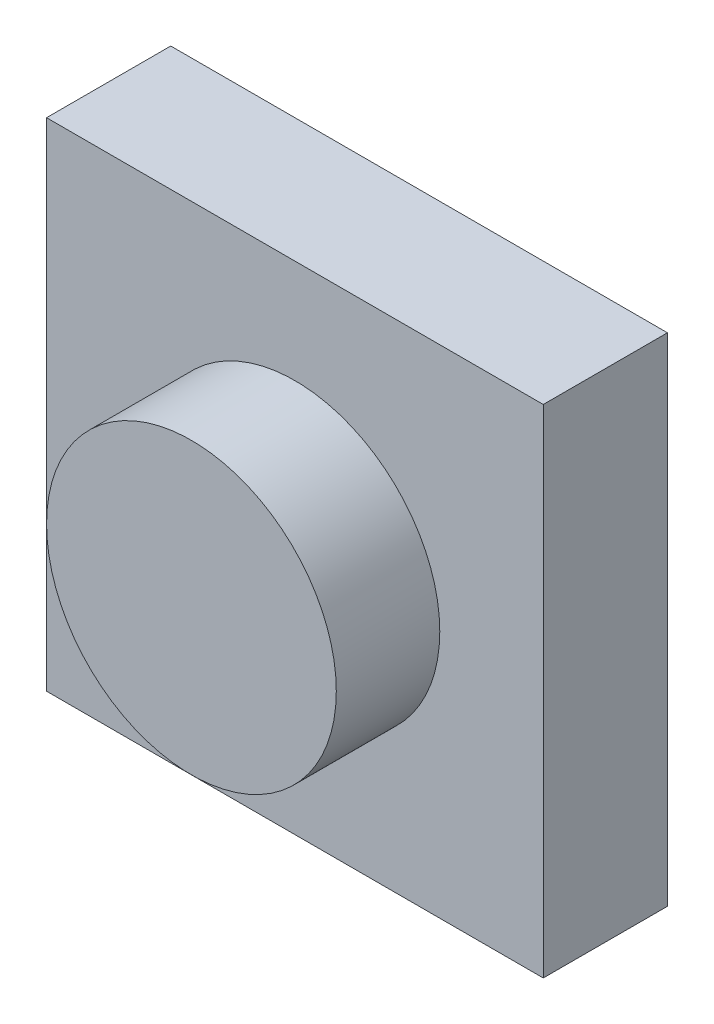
from build123d import *

# Parameters (mm, degrees)
SKETCH1_W           = 120
SKETCH1_H           = 120
BOSS_EXTRUDE1_DEPTH = 30
SKETCH2_R           = 35
BOSS_EXTRUDE2_DEPTH = 25


with BuildPart() as part:
    # Sketch1 → Boss-Extrude1 (new body)
    with BuildSketch(Plane.XY):
        with Locations((60, 60)):
            Rectangle(SKETCH1_W, SKETCH1_H)
    extrude(amount=BOSS_EXTRUDE1_DEPTH)

    # Sketch2 → Boss-Extrude2 (add)
    with BuildSketch(Plane.XY.offset(30)):
        with Locations(Location((60, 60, 0), (0, 0, 180))):
            Circle(SKETCH2_R)
    extrude(amount=BOSS_EXTRUDE2_DEPTH)


solid = part.part
